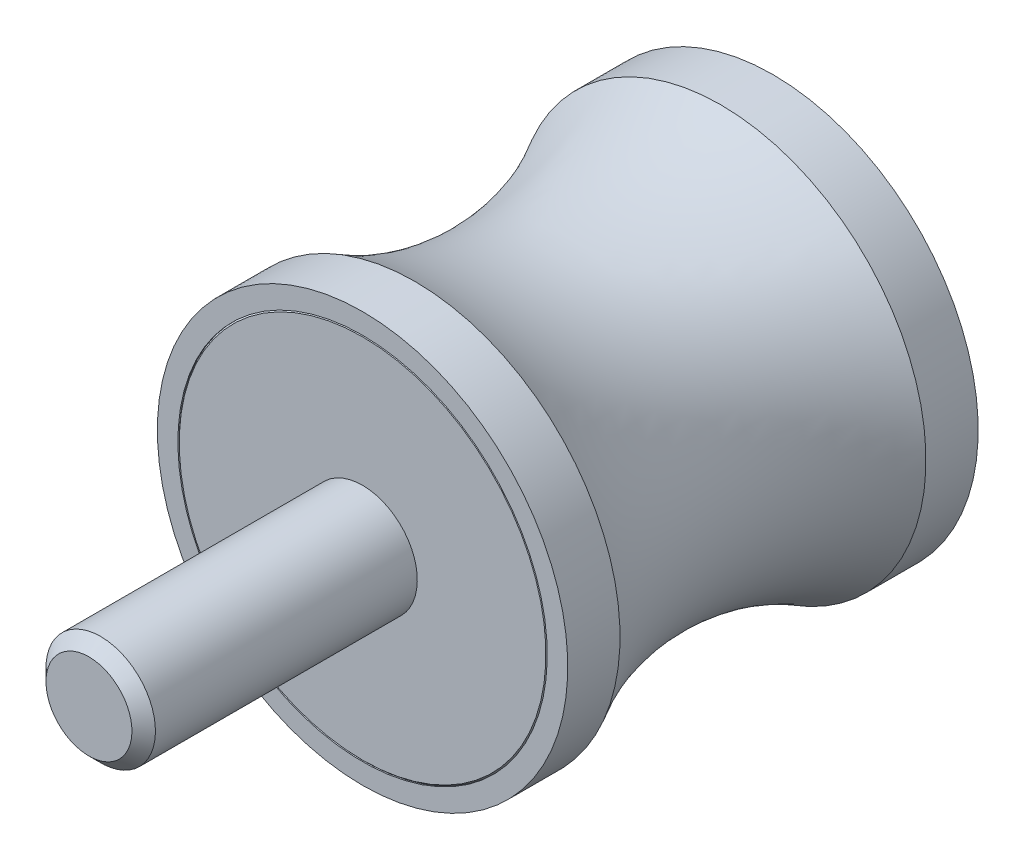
ISO-10303-21;
HEADER;
FILE_DESCRIPTION(('STEP AP214'),'2;1');
FILE_NAME('part.step','',(''),(''),'','','');
FILE_SCHEMA(('AUTOMOTIVE_DESIGN { 1 0 10303 214 1 1 1 1 }'));
ENDSEC;
DATA;
#1=APPLICATION_CONTEXT('core data for automotive mechanical design processes');
#2=APPLICATION_PROTOCOL_DEFINITION('international standard','automotive_design',2000,#1);
#3=PRODUCT_CONTEXT('',#1,'mechanical');
#4=PRODUCT('Part','Part','',(#3));
#5=PRODUCT_RELATED_PRODUCT_CATEGORY('part','',(#4));
#6=PRODUCT_DEFINITION_FORMATION('','',#4);
#7=PRODUCT_DEFINITION_CONTEXT('part definition',#1,'design');
#8=PRODUCT_DEFINITION('design','',#6,#7);
#9=PRODUCT_DEFINITION_SHAPE('','',#8);
#10=(LENGTH_UNIT() NAMED_UNIT(*) SI_UNIT(.MILLI.,.METRE.));
#11=(NAMED_UNIT(*) PLANE_ANGLE_UNIT() SI_UNIT($,.RADIAN.));
#12=(NAMED_UNIT(*) SI_UNIT($,.STERADIAN.) SOLID_ANGLE_UNIT());
#13=UNCERTAINTY_MEASURE_WITH_UNIT(LENGTH_MEASURE(1.E-05),#10,'distance_accuracy_value','');
#14=(GEOMETRIC_REPRESENTATION_CONTEXT(3) GLOBAL_UNCERTAINTY_ASSIGNED_CONTEXT((#13)) GLOBAL_UNIT_ASSIGNED_CONTEXT((#10,
#11,#12)) REPRESENTATION_CONTEXT('',''));
#15=CARTESIAN_POINT('',(0.,0.,0.));
#16=DIRECTION('',(0.,0.,1.));
#17=DIRECTION('',(1.,0.,0.));
#18=AXIS2_PLACEMENT_3D('',#15,#16,#17);
#19=CARTESIAN_POINT('',(0.,0.,0.5));
#20=DIRECTION('',(0.,0.,-1.));
#21=DIRECTION('',(0.,1.,0.));
#22=AXIS2_PLACEMENT_3D('',#19,#20,#21);
#23=CYLINDRICAL_SURFACE('',#22,6.75);
#24=CARTESIAN_POINT('',(0.,0.,0.05));
#25=DIRECTION('',(0.,0.,-1.));
#26=DIRECTION('',(0.,1.,0.));
#27=AXIS2_PLACEMENT_3D('',#24,#25,#26);
#28=CIRCLE('',#27,6.75);
#29=CARTESIAN_POINT('',(0.,6.75,0.05));
#30=VERTEX_POINT('',#29);
#31=EDGE_CURVE('E53',#30,#30,#28,.T.);
#32=ORIENTED_EDGE('',*,*,#31,.F.);
#33=EDGE_LOOP('',(#32));
#34=FACE_BOUND('',#33,.T.);
#35=CARTESIAN_POINT('',(0.,0.,0.));
#36=DIRECTION('',(0.,0.,-1.));
#37=DIRECTION('',(0.,1.,0.));
#38=AXIS2_PLACEMENT_3D('',#35,#36,#37);
#39=CIRCLE('',#38,6.75);
#40=CARTESIAN_POINT('',(0.,6.75,0.));
#41=VERTEX_POINT('',#40);
#42=EDGE_CURVE('E44',#41,#41,#39,.T.);
#43=ORIENTED_EDGE('',*,*,#42,.T.);
#44=EDGE_LOOP('',(#43));
#45=FACE_BOUND('',#44,.T.);
#46=ADVANCED_FACE('F12',(#34,#45),#23,.F.);
#47=CARTESIAN_POINT('',(0.,0.,0.5));
#48=DIRECTION('',(0.,0.,-1.));
#49=DIRECTION('',(0.,1.,0.));
#50=AXIS2_PLACEMENT_3D('',#47,#48,#49);
#51=CYLINDRICAL_SURFACE('',#50,6.75);
#52=CARTESIAN_POINT('',(0.,0.,15.));
#53=DIRECTION('',(0.,0.,-1.));
#54=DIRECTION('',(0.,1.,0.));
#55=AXIS2_PLACEMENT_3D('',#52,#53,#54);
#56=CIRCLE('',#55,6.75);
#57=CARTESIAN_POINT('',(0.,6.75,15.));
#58=VERTEX_POINT('',#57);
#59=EDGE_CURVE('E27',#58,#58,#56,.T.);
#60=ORIENTED_EDGE('',*,*,#59,.F.);
#61=EDGE_LOOP('',(#60));
#62=FACE_BOUND('',#61,.T.);
#63=CARTESIAN_POINT('',(0.,0.,14.95));
#64=DIRECTION('',(0.,0.,-1.));
#65=DIRECTION('',(0.,1.,0.));
#66=AXIS2_PLACEMENT_3D('',#63,#64,#65);
#67=CIRCLE('',#66,6.75);
#68=CARTESIAN_POINT('',(0.,6.75,14.95));
#69=VERTEX_POINT('',#68);
#70=EDGE_CURVE('E50',#69,#69,#67,.T.);
#71=ORIENTED_EDGE('',*,*,#70,.T.);
#72=EDGE_LOOP('',(#71));
#73=FACE_BOUND('',#72,.T.);
#74=ADVANCED_FACE('F89',(#62,#73),#51,.F.);
#75=CARTESIAN_POINT('',(6.75,0.,15.));
#76=DIRECTION('',(0.,0.,-1.));
#77=DIRECTION('',(0.,1.,0.));
#78=AXIS2_PLACEMENT_3D('',#75,#76,#77);
#79=PLANE('',#78);
#80=CARTESIAN_POINT('',(0.,0.,15.));
#81=DIRECTION('',(0.,0.,-1.));
#82=DIRECTION('',(0.,1.,0.));
#83=AXIS2_PLACEMENT_3D('',#80,#81,#82);
#84=CIRCLE('',#83,7.5);
#85=CARTESIAN_POINT('',(0.,7.5,15.));
#86=VERTEX_POINT('',#85);
#87=EDGE_CURVE('E32',#86,#86,#84,.T.);
#88=ORIENTED_EDGE('',*,*,#87,.F.);
#89=EDGE_LOOP('',(#88));
#90=FACE_BOUND('',#89,.T.);
#91=ORIENTED_EDGE('',*,*,#59,.T.);
#92=EDGE_LOOP('',(#91));
#93=FACE_BOUND('',#92,.T.);
#94=ADVANCED_FACE('F115',(#90,#93),#79,.F.);
#95=CARTESIAN_POINT('',(0.,0.,0.5));
#96=DIRECTION('',(0.,0.,-1.));
#97=DIRECTION('',(0.,1.,0.));
#98=AXIS2_PLACEMENT_3D('',#95,#96,#97);
#99=CYLINDRICAL_SURFACE('',#98,7.5);
#100=CARTESIAN_POINT('',(0.,0.,13.0901699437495));
#101=DIRECTION('',(0.,0.,-1.));
#102=DIRECTION('',(0.,1.,0.));
#103=AXIS2_PLACEMENT_3D('',#100,#101,#102);
#104=CIRCLE('',#103,7.5);
#105=CARTESIAN_POINT('',(0.,7.5,13.0901699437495));
#106=VERTEX_POINT('',#105);
#107=EDGE_CURVE('E35',#106,#106,#104,.T.);
#108=ORIENTED_EDGE('',*,*,#107,.F.);
#109=EDGE_LOOP('',(#108));
#110=FACE_BOUND('',#109,.T.);
#111=ORIENTED_EDGE('',*,*,#87,.T.);
#112=EDGE_LOOP('',(#111));
#113=FACE_BOUND('',#112,.T.);
#114=ADVANCED_FACE('F109',(#110,#113),#99,.T.);
#115=CARTESIAN_POINT('',(0.,0.,7.5));
#116=DIRECTION('',(0.,0.,-1.));
#117=DIRECTION('',(0.,1.,0.));
#118=AXIS2_PLACEMENT_3D('',#115,#116,#117);
#119=TOROIDAL_SURFACE('',#118,17.1666666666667,11.1666666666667);
#120=CARTESIAN_POINT('',(0.,0.,1.90983005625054));
#121=DIRECTION('',(0.,0.,-1.));
#122=DIRECTION('',(0.,1.,0.));
#123=AXIS2_PLACEMENT_3D('',#120,#121,#122);
#124=CIRCLE('',#123,7.5);
#125=CARTESIAN_POINT('',(0.,7.5,1.90983005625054));
#126=VERTEX_POINT('',#125);
#127=EDGE_CURVE('E38',#126,#126,#124,.T.);
#128=ORIENTED_EDGE('',*,*,#127,.F.);
#129=EDGE_LOOP('',(#128));
#130=FACE_BOUND('',#129,.T.);
#131=ORIENTED_EDGE('',*,*,#107,.T.);
#132=EDGE_LOOP('',(#131));
#133=FACE_BOUND('',#132,.T.);
#134=ADVANCED_FACE('F103',(#130,#133),#119,.F.);
#135=CARTESIAN_POINT('',(0.,0.,0.5));
#136=DIRECTION('',(0.,0.,-1.));
#137=DIRECTION('',(0.,1.,0.));
#138=AXIS2_PLACEMENT_3D('',#135,#136,#137);
#139=CYLINDRICAL_SURFACE('',#138,7.5);
#140=CARTESIAN_POINT('',(0.,0.,0.));
#141=DIRECTION('',(0.,0.,-1.));
#142=DIRECTION('',(0.,1.,0.));
#143=AXIS2_PLACEMENT_3D('',#140,#141,#142);
#144=CIRCLE('',#143,7.5);
#145=CARTESIAN_POINT('',(0.,7.5,0.));
#146=VERTEX_POINT('',#145);
#147=EDGE_CURVE('E41',#146,#146,#144,.T.);
#148=ORIENTED_EDGE('',*,*,#147,.F.);
#149=EDGE_LOOP('',(#148));
#150=FACE_BOUND('',#149,.T.);
#151=ORIENTED_EDGE('',*,*,#127,.T.);
#152=EDGE_LOOP('',(#151));
#153=FACE_BOUND('',#152,.T.);
#154=ADVANCED_FACE('F97',(#150,#153),#139,.T.);
#155=CARTESIAN_POINT('',(7.5,0.,0.));
#156=DIRECTION('',(0.,0.,1.));
#157=DIRECTION('',(0.,-1.,0.));
#158=AXIS2_PLACEMENT_3D('',#155,#156,#157);
#159=PLANE('',#158);
#160=ORIENTED_EDGE('',*,*,#42,.F.);
#161=EDGE_LOOP('',(#160));
#162=FACE_BOUND('',#161,.T.);
#163=ORIENTED_EDGE('',*,*,#147,.T.);
#164=EDGE_LOOP('',(#163));
#165=FACE_BOUND('',#164,.T.);
#166=ADVANCED_FACE('F93',(#162,#165),#159,.F.);
#167=CARTESIAN_POINT('',(0.,0.,15.));
#168=DIRECTION('',(0.,0.,-1.));
#169=DIRECTION('',(0.,1.,0.));
#170=AXIS2_PLACEMENT_3D('',#167,#168,#169);
#171=PLANE('',#170);
#172=CARTESIAN_POINT('',(0.,0.,15.));
#173=DIRECTION('',(0.,0.,-1.));
#174=DIRECTION('',(0.,1.,0.));
#175=AXIS2_PLACEMENT_3D('',#172,#173,#174);
#176=CIRCLE('',#175,6.7);
#177=CARTESIAN_POINT('',(0.,6.7,15.));
#178=VERTEX_POINT('',#177);
#179=EDGE_CURVE('E47',#178,#178,#176,.T.);
#180=ORIENTED_EDGE('',*,*,#179,.F.);
#181=EDGE_LOOP('',(#180));
#182=FACE_BOUND('',#181,.T.);
#183=CARTESIAN_POINT('',(0.,0.,15.));
#184=DIRECTION('',(0.,0.,-1.));
#185=DIRECTION('',(0.,1.,0.));
#186=AXIS2_PLACEMENT_3D('',#183,#184,#185);
#187=CIRCLE('',#186,2.);
#188=CARTESIAN_POINT('',(0.,2.,15.));
#189=VERTEX_POINT('',#188);
#190=EDGE_CURVE('E8',#189,#189,#187,.T.);
#191=ORIENTED_EDGE('',*,*,#190,.T.);
#192=EDGE_LOOP('',(#191));
#193=FACE_BOUND('',#192,.T.);
#194=ADVANCED_FACE('F96',(#182,#193),#171,.F.);
#195=CARTESIAN_POINT('',(0.,0.,15.));
#196=DIRECTION('',(0.,0.,-1.));
#197=DIRECTION('',(0.,1.,0.));
#198=AXIS2_PLACEMENT_3D('',#195,#196,#197);
#199=CONICAL_SURFACE('',#198,6.7,0.785398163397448);
#200=ORIENTED_EDGE('',*,*,#70,.F.);
#201=EDGE_LOOP('',(#200));
#202=FACE_BOUND('',#201,.T.);
#203=ORIENTED_EDGE('',*,*,#179,.T.);
#204=EDGE_LOOP('',(#203));
#205=FACE_BOUND('',#204,.T.);
#206=ADVANCED_FACE('F129',(#202,#205),#199,.T.);
#207=CARTESIAN_POINT('',(0.,0.,25.));
#208=DIRECTION('',(0.,0.,-1.));
#209=DIRECTION('',(0.,1.,0.));
#210=AXIS2_PLACEMENT_3D('',#207,#208,#209);
#211=PLANE('',#210);
#212=CARTESIAN_POINT('',(0.,0.,25.));
#213=DIRECTION('',(0.,0.,-1.));
#214=DIRECTION('',(0.,1.,0.));
#215=AXIS2_PLACEMENT_3D('',#212,#213,#214);
#216=CIRCLE('',#215,1.5705);
#217=CARTESIAN_POINT('',(0.,1.5705,25.));
#218=VERTEX_POINT('',#217);
#219=EDGE_CURVE('E19',#218,#218,#216,.T.);
#220=ORIENTED_EDGE('',*,*,#219,.F.);
#221=EDGE_LOOP('',(#220));
#222=FACE_BOUND('',#221,.T.);
#223=ADVANCED_FACE('F14',(#222),#211,.F.);
#224=CARTESIAN_POINT('',(0.,0.,25.));
#225=DIRECTION('',(0.,0.,-1.));
#226=DIRECTION('',(0.,1.,0.));
#227=AXIS2_PLACEMENT_3D('',#224,#225,#226);
#228=CONICAL_SURFACE('',#227,1.5705,0.785398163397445);
#229=CARTESIAN_POINT('',(0.,0.,24.5705));
#230=DIRECTION('',(0.,0.,-1.));
#231=DIRECTION('',(0.,1.,0.));
#232=AXIS2_PLACEMENT_3D('',#229,#230,#231);
#233=CIRCLE('',#232,2.);
#234=CARTESIAN_POINT('',(0.,2.,24.5705));
#235=VERTEX_POINT('',#234);
#236=EDGE_CURVE('E23',#235,#235,#233,.T.);
#237=ORIENTED_EDGE('',*,*,#236,.F.);
#238=EDGE_LOOP('',(#237));
#239=FACE_BOUND('',#238,.T.);
#240=ORIENTED_EDGE('',*,*,#219,.T.);
#241=EDGE_LOOP('',(#240));
#242=FACE_BOUND('',#241,.T.);
#243=ADVANCED_FACE('F142',(#239,#242),#228,.T.);
#244=CARTESIAN_POINT('',(0.,0.,0.5));
#245=DIRECTION('',(0.,0.,-1.));
#246=DIRECTION('',(0.,1.,0.));
#247=AXIS2_PLACEMENT_3D('',#244,#245,#246);
#248=CYLINDRICAL_SURFACE('',#247,2.);
#249=ORIENTED_EDGE('',*,*,#190,.F.);
#250=EDGE_LOOP('',(#249));
#251=FACE_BOUND('',#250,.T.);
#252=ORIENTED_EDGE('',*,*,#236,.T.);
#253=EDGE_LOOP('',(#252));
#254=FACE_BOUND('',#253,.T.);
#255=ADVANCED_FACE('F83',(#251,#254),#248,.T.);
#256=CARTESIAN_POINT('',(0.,0.,0.05));
#257=DIRECTION('',(0.,0.,1.));
#258=DIRECTION('',(0.,-1.,0.));
#259=AXIS2_PLACEMENT_3D('',#256,#257,#258);
#260=CONICAL_SURFACE('',#259,6.75,0.785398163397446);
#261=CARTESIAN_POINT('',(0.,0.,0.));
#262=DIRECTION('',(0.,0.,-1.));
#263=DIRECTION('',(0.,1.,0.));
#264=AXIS2_PLACEMENT_3D('',#261,#262,#263);
#265=CIRCLE('',#264,6.7);
#266=CARTESIAN_POINT('',(0.,6.7,0.));
#267=VERTEX_POINT('',#266);
#268=EDGE_CURVE('E56',#267,#267,#265,.T.);
#269=ORIENTED_EDGE('',*,*,#268,.F.);
#270=EDGE_LOOP('',(#269));
#271=FACE_BOUND('',#270,.T.);
#272=ORIENTED_EDGE('',*,*,#31,.T.);
#273=EDGE_LOOP('',(#272));
#274=FACE_BOUND('',#273,.T.);
#275=ADVANCED_FACE('F77',(#271,#274),#260,.T.);
#276=CARTESIAN_POINT('',(6.7,0.,0.));
#277=DIRECTION('',(0.,0.,1.));
#278=DIRECTION('',(0.,-1.,0.));
#279=AXIS2_PLACEMENT_3D('',#276,#277,#278);
#280=PLANE('',#279);
#281=CARTESIAN_POINT('',(0.,0.,0.));
#282=DIRECTION('',(0.,0.,-1.));
#283=DIRECTION('',(0.,1.,0.));
#284=AXIS2_PLACEMENT_3D('',#281,#282,#283);
#285=CIRCLE('',#284,2.);
#286=CARTESIAN_POINT('',(0.,2.,0.));
#287=VERTEX_POINT('',#286);
#288=EDGE_CURVE('E60',#287,#287,#285,.T.);
#289=ORIENTED_EDGE('',*,*,#288,.F.);
#290=EDGE_LOOP('',(#289));
#291=FACE_BOUND('',#290,.T.);
#292=ORIENTED_EDGE('',*,*,#268,.T.);
#293=EDGE_LOOP('',(#292));
#294=FACE_BOUND('',#293,.T.);
#295=ADVANCED_FACE('F71',(#291,#294),#280,.F.);
#296=CARTESIAN_POINT('',(0.,0.,4.));
#297=DIRECTION('',(0.,0.,-1.));
#298=DIRECTION('',(0.,1.,0.));
#299=AXIS2_PLACEMENT_3D('',#296,#297,#298);
#300=CYLINDRICAL_SURFACE('',#299,2.);
#301=CARTESIAN_POINT('',(0.,0.,4.));
#302=DIRECTION('',(0.,0.,-1.));
#303=DIRECTION('',(0.,1.,0.));
#304=AXIS2_PLACEMENT_3D('',#301,#302,#303);
#305=CIRCLE('',#304,2.);
#306=CARTESIAN_POINT('',(0.,2.,4.));
#307=VERTEX_POINT('',#306);
#308=EDGE_CURVE('E59',#307,#307,#305,.T.);
#309=ORIENTED_EDGE('',*,*,#308,.F.);
#310=EDGE_LOOP('',(#309));
#311=FACE_BOUND('',#310,.T.);
#312=ORIENTED_EDGE('',*,*,#288,.T.);
#313=EDGE_LOOP('',(#312));
#314=FACE_BOUND('',#313,.T.);
#315=ADVANCED_FACE('F68',(#311,#314),#300,.F.);
#316=CARTESIAN_POINT('',(0.,0.,4.));
#317=DIRECTION('',(0.,0.,-1.));
#318=DIRECTION('',(0.,1.,0.));
#319=AXIS2_PLACEMENT_3D('',#316,#317,#318);
#320=PLANE('',#319);
#321=ORIENTED_EDGE('',*,*,#308,.T.);
#322=EDGE_LOOP('',(#321));
#323=FACE_BOUND('',#322,.T.);
#324=ADVANCED_FACE('F66',(#323),#320,.T.);
#325=CLOSED_SHELL('',(#46,#74,#94,#114,#134,#154,#166,#194,#206,#223,#243,#255,#275,#295,#315,#324));
#326=MANIFOLD_SOLID_BREP('B1',#325);
#327=ADVANCED_BREP_SHAPE_REPRESENTATION('',(#18,#326),#14);
#328=SHAPE_DEFINITION_REPRESENTATION(#9,#327);
ENDSEC;
END-ISO-10303-21;
